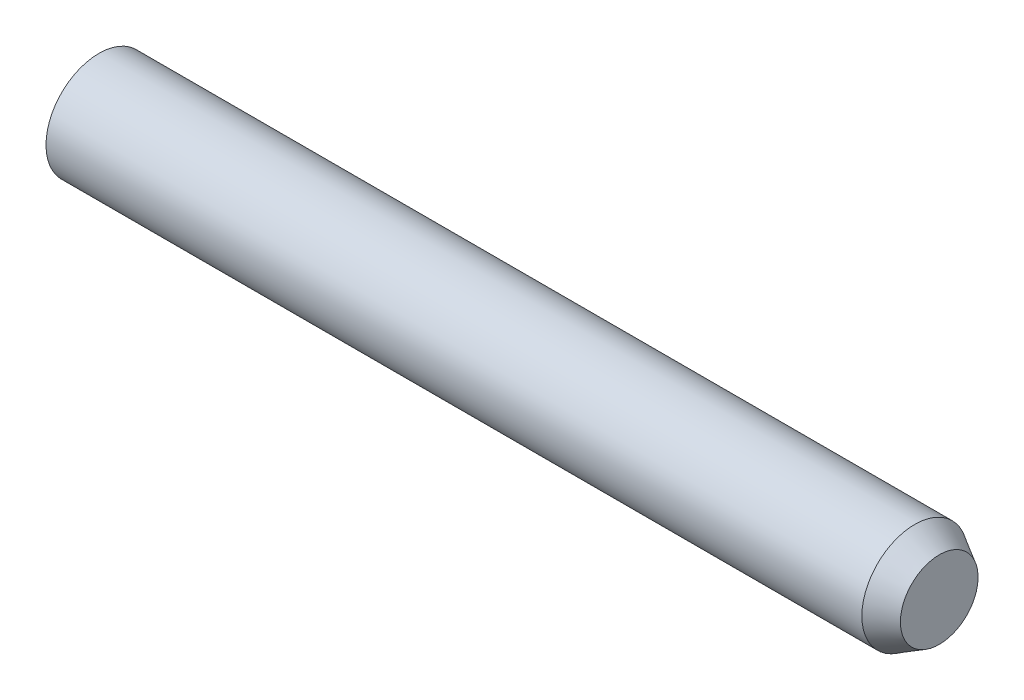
ISO-10303-21;
HEADER;
FILE_DESCRIPTION(('STEP AP214'),'2;1');
FILE_NAME('part.step','',(''),(''),'','','');
FILE_SCHEMA(('AUTOMOTIVE_DESIGN { 1 0 10303 214 1 1 1 1 }'));
ENDSEC;
DATA;
#1=APPLICATION_CONTEXT('core data for automotive mechanical design processes');
#2=APPLICATION_PROTOCOL_DEFINITION('international standard','automotive_design',2000,#1);
#3=PRODUCT_CONTEXT('',#1,'mechanical');
#4=PRODUCT('Part','Part','',(#3));
#5=PRODUCT_RELATED_PRODUCT_CATEGORY('part','',(#4));
#6=PRODUCT_DEFINITION_FORMATION('','',#4);
#7=PRODUCT_DEFINITION_CONTEXT('part definition',#1,'design');
#8=PRODUCT_DEFINITION('design','',#6,#7);
#9=PRODUCT_DEFINITION_SHAPE('','',#8);
#10=(LENGTH_UNIT() NAMED_UNIT(*) SI_UNIT(.MILLI.,.METRE.));
#11=(NAMED_UNIT(*) PLANE_ANGLE_UNIT() SI_UNIT($,.RADIAN.));
#12=(NAMED_UNIT(*) SI_UNIT($,.STERADIAN.) SOLID_ANGLE_UNIT());
#13=UNCERTAINTY_MEASURE_WITH_UNIT(LENGTH_MEASURE(1.E-05),#10,'distance_accuracy_value','');
#14=(GEOMETRIC_REPRESENTATION_CONTEXT(3) GLOBAL_UNCERTAINTY_ASSIGNED_CONTEXT((#13)) GLOBAL_UNIT_ASSIGNED_CONTEXT((#10,
#11,#12)) REPRESENTATION_CONTEXT('',''));
#15=CARTESIAN_POINT('',(0.,0.,0.));
#16=DIRECTION('',(0.,0.,1.));
#17=DIRECTION('',(1.,0.,0.));
#18=AXIS2_PLACEMENT_3D('',#15,#16,#17);
#19=CARTESIAN_POINT('',(12.,1.5,0.));
#20=DIRECTION('',(-1.,0.,0.));
#21=DIRECTION('',(0.,0.,1.));
#22=AXIS2_PLACEMENT_3D('',#19,#20,#21);
#23=PLANE('',#22);
#24=CARTESIAN_POINT('',(12.,0.,0.));
#25=DIRECTION('',(-1.,0.,0.));
#26=DIRECTION('',(0.,0.,1.));
#27=AXIS2_PLACEMENT_3D('',#24,#25,#26);
#28=CIRCLE('',#27,1.09999999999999);
#29=CARTESIAN_POINT('',(12.,0.,1.09999999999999));
#30=VERTEX_POINT('',#29);
#31=EDGE_CURVE('E10',#30,#30,#28,.F.);
#32=ORIENTED_EDGE('',*,*,#31,.T.);
#33=EDGE_LOOP('',(#32));
#34=FACE_BOUND('',#33,.T.);
#35=ADVANCED_FACE('F27',(#34),#23,.F.);
#36=CARTESIAN_POINT('',(-46.9437246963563,0.,0.));
#37=DIRECTION('',(-1.,0.,0.));
#38=DIRECTION('',(0.,0.,1.));
#39=AXIS2_PLACEMENT_3D('',#36,#37,#38);
#40=CYLINDRICAL_SURFACE('',#39,1.5);
#41=CARTESIAN_POINT('',(11.3071796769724,0.,0.));
#42=DIRECTION('',(-1.,0.,0.));
#43=DIRECTION('',(0.,0.,1.));
#44=AXIS2_PLACEMENT_3D('',#41,#42,#43);
#45=CIRCLE('',#44,1.5);
#46=CARTESIAN_POINT('',(11.3071796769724,0.,1.5));
#47=VERTEX_POINT('',#46);
#48=EDGE_CURVE('E33',#47,#47,#45,.T.);
#49=ORIENTED_EDGE('',*,*,#48,.T.);
#50=EDGE_LOOP('',(#49));
#51=FACE_BOUND('',#50,.T.);
#52=CARTESIAN_POINT('',(-11.8094750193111,0.,0.));
#53=DIRECTION('',(-1.,0.,0.));
#54=DIRECTION('',(0.,0.,1.));
#55=AXIS2_PLACEMENT_3D('',#52,#53,#54);
#56=CIRCLE('',#55,1.5);
#57=CARTESIAN_POINT('',(-11.8094750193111,0.,1.5));
#58=VERTEX_POINT('',#57);
#59=EDGE_CURVE('E37',#58,#58,#56,.T.);
#60=ORIENTED_EDGE('',*,*,#59,.F.);
#61=EDGE_LOOP('',(#60));
#62=FACE_BOUND('',#61,.T.);
#63=ADVANCED_FACE('F46',(#51,#62),#40,.T.);
#64=CARTESIAN_POINT('',(-6.,0.,0.));
#65=DIRECTION('',(-1.,0.,0.));
#66=DIRECTION('',(0.,1.,0.));
#67=AXIS2_PLACEMENT_3D('',#64,#65,#66);
#68=SPHERICAL_SURFACE('',#67,6.00000000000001);
#69=ORIENTED_EDGE('',*,*,#59,.T.);
#70=EDGE_LOOP('',(#69));
#71=FACE_BOUND('',#70,.T.);
#72=ADVANCED_FACE('F44',(#71),#68,.T.);
#73=CARTESIAN_POINT('',(11.3071796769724,0.,0.));
#74=DIRECTION('',(-1.,0.,0.));
#75=DIRECTION('',(0.,0.,1.));
#76=AXIS2_PLACEMENT_3D('',#73,#74,#75);
#77=CONICAL_SURFACE('',#76,1.5,0.523598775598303);
#78=ORIENTED_EDGE('',*,*,#31,.F.);
#79=EDGE_LOOP('',(#78));
#80=FACE_BOUND('',#79,.T.);
#81=ORIENTED_EDGE('',*,*,#48,.F.);
#82=EDGE_LOOP('',(#81));
#83=FACE_BOUND('',#82,.T.);
#84=ADVANCED_FACE('F52',(#80,#83),#77,.T.);
#85=CLOSED_SHELL('',(#35,#63,#72,#84));
#86=MANIFOLD_SOLID_BREP('B2',#85);
#87=ADVANCED_BREP_SHAPE_REPRESENTATION('',(#18,#86),#14);
#88=SHAPE_DEFINITION_REPRESENTATION(#9,#87);
ENDSEC;
END-ISO-10303-21;
